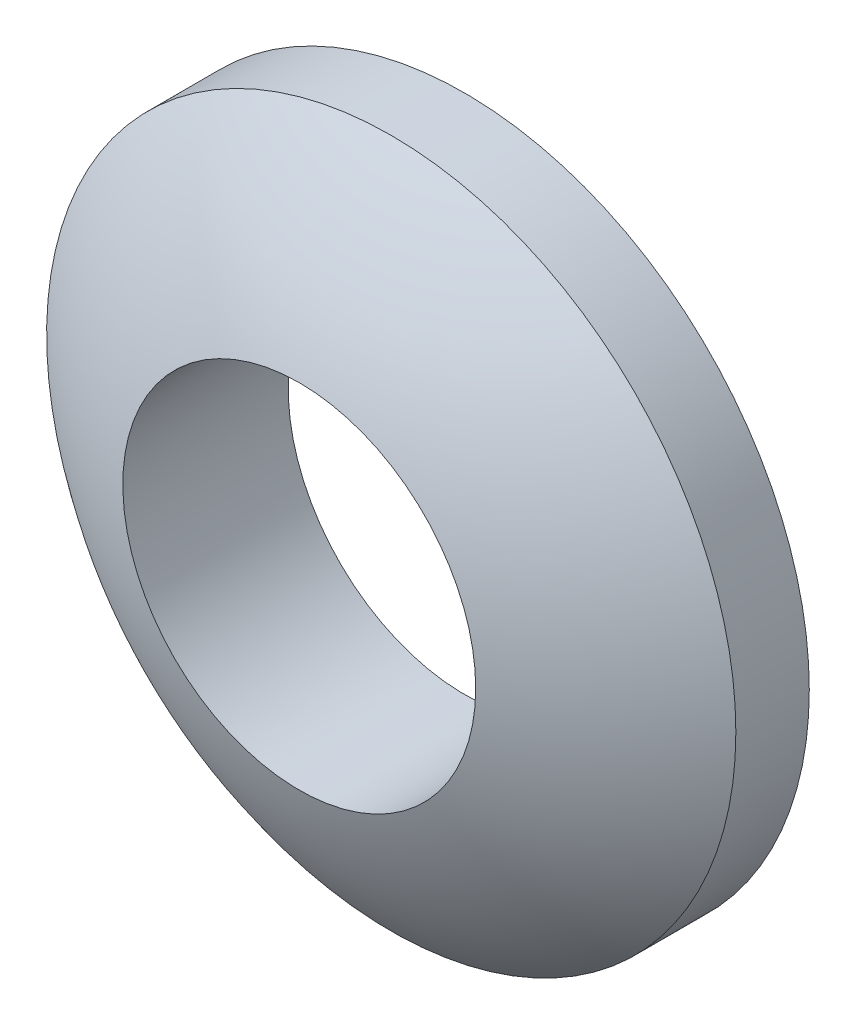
from build123d import *


with BuildPart() as part:
    # Sketch1 → Base-Revolve (revolve)
    with BuildSketch(Plane(origin=(0, 0, 0), x_dir=(0, -1, 0), z_dir=(-1, 0, 0)), mode=Mode.PRIVATE) as base_revolve_sk:
        with BuildLine():
            Line((-3.2, -3), (-6.25, -3))
            Line((-6.25, -3), (-6.25, -1.667927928))
            ThreePointArc((-6.25, -1.667927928), (-4.798033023, -0.700414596), (-3.2, 0))
            Line((-3.2, 0), (-3.2, -3))
        make_face()
    revolve(base_revolve_sk.sketch.rotate(Axis((0, 0, 58.050097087), (0, 0, -1)), 90), axis=Axis((0, 0, 58.050097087), (0, 0, -1)))


solid = part.part
